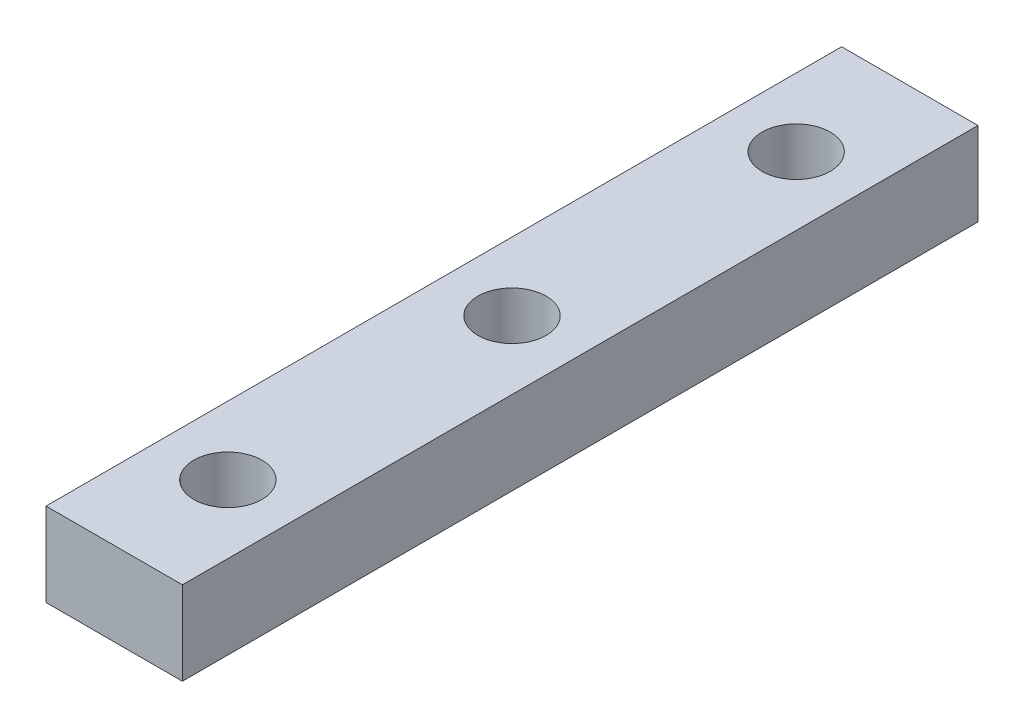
from build123d import *

# Parameters (mm, degrees)
SKETCH_1_W          = 12
SKETCH_1_H          = 7.35
EXTRUDE_1_DEPTH     = 70
SKETCH_2_R          = 1.75
CUT_EXTRUDE_1_DEPTH = 70
SKETCH_3_R          = 3
CUT_EXTRUDE_2_DEPTH = 4.5


with BuildPart() as part:
    # Sketch 1 → Extrude 1 (new body)
    with BuildSketch(Plane.XY):
        with Locations((6, 3.675)):
            Rectangle(SKETCH_1_W, SKETCH_1_H)
    extrude(amount=EXTRUDE_1_DEPTH)

    # Sketch 2 → Cut-Extrude 1 (cut)
    with BuildSketch(Plane(origin=(0, 7.35, 0), x_dir=(1, 0, 0), z_dir=(0, 1, 0))):
        with Locations(Location((6, -10, 0), (0, 0, 270))):
            Circle(SKETCH_2_R)
        with Locations(Location((6, -35, 0), (0, 0, 270))):
            Circle(SKETCH_2_R)
        with Locations(Location((6, -60, 0), (0, 0, 270))):
            Circle(SKETCH_2_R)
    extrude(amount=-CUT_EXTRUDE_1_DEPTH, mode=Mode.SUBTRACT)

    # Sketch 3 → Cut-Extrude 2 (cut)
    with BuildSketch(Plane(origin=(0, 7.35, 0), x_dir=(1, 0, 0), z_dir=(0, 1, 0))):
        with Locations(Location((6, -10, 0), (0, 0, 270))):
            Circle(SKETCH_3_R)
        with Locations(Location((6, -35, 0), (0, 0, 270))):
            Circle(SKETCH_3_R)
        with Locations(Location((6, -60, 0), (0, 0, 270))):
            Circle(SKETCH_3_R)
    extrude(amount=-CUT_EXTRUDE_2_DEPTH, mode=Mode.SUBTRACT)


solid = part.part
